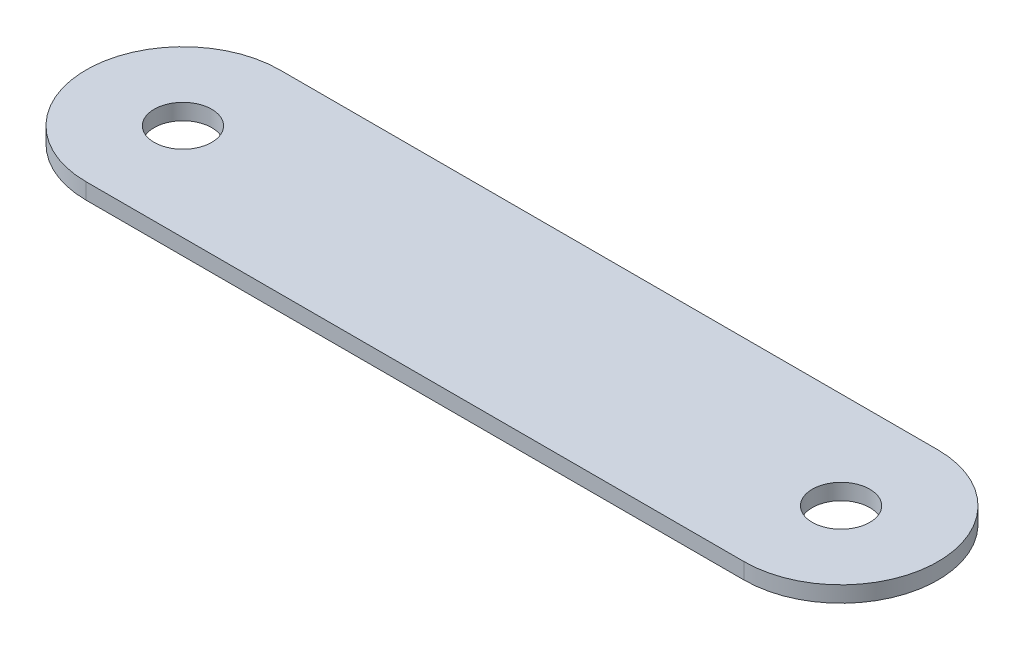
from build123d import *

# Parameters (mm, degrees)
SKETCH1_R           = 5.4
BOSS_EXTRUDE1_DEPTH = 3


with BuildPart() as part:
    # Sketch1 → Boss-Extrude1 (new body)
    with BuildSketch(Plane(origin=(0, 0, 0), x_dir=(1, 0, 0), z_dir=(0, 1, 0))):
        with BuildLine():
            Line((-61.8, 18.193025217), (61.8, 18.193025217))
            ThreePointArc((61.8, 18.193025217), (79.993025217, 0), (61.8, -18.193025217))
            Line((61.8, -18.193025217), (-61.8, -18.193025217))
            ThreePointArc((-61.8, -18.193025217), (-79.993025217, 0), (-61.8, 18.193025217))
        make_face()
        with Locations(Location((-61.8, 0, 0), (0, 0, 270))):
            Circle(SKETCH1_R, mode=Mode.SUBTRACT)
        with Locations(Location((61.8, 0, 0), (0, 0, 90))):
            Circle(SKETCH1_R, mode=Mode.SUBTRACT)
    extrude(amount=BOSS_EXTRUDE1_DEPTH)


solid = part.part
